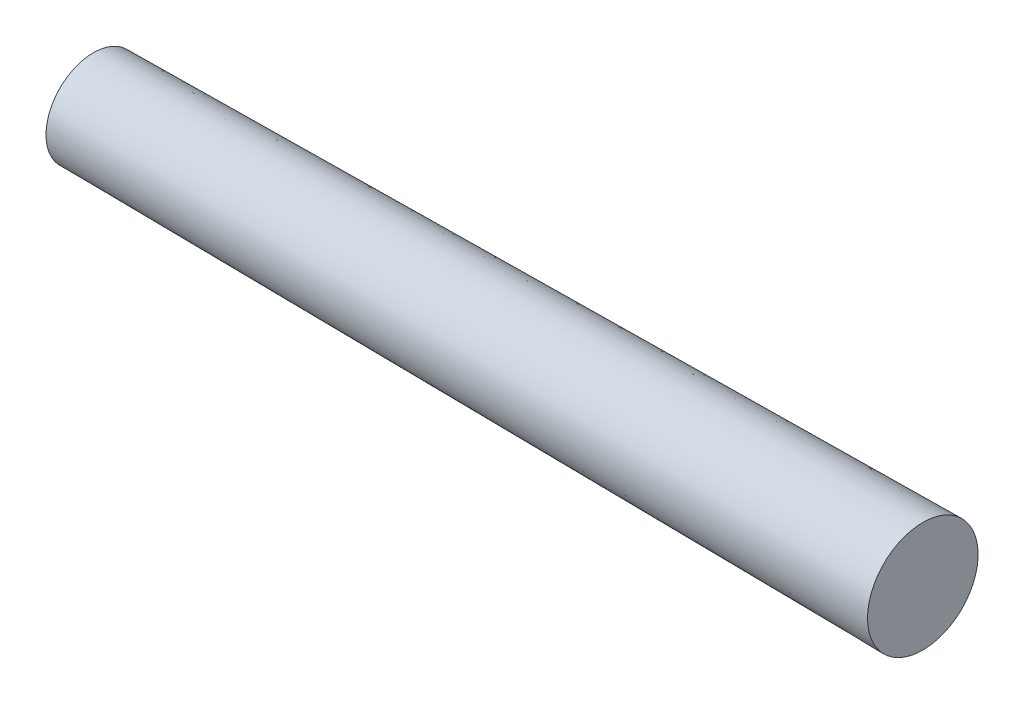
from build123d import *


with BuildPart() as part:
    # Sketch1 → Revolve1 (revolve)
    with BuildSketch(Plane.XY, mode=Mode.PRIVATE) as revolve1_sk:
        Polygon((52.5, 0), (52.5, 7), (-52.5, 6), (-52.5, 0), align=None)
    revolve(revolve1_sk.sketch.rotate(Axis((-76.114993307, 0, 0), (1, 0, 0)), 90), axis=Axis((-76.114993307, 0, 0), (1, 0, 0)))


solid = part.part
